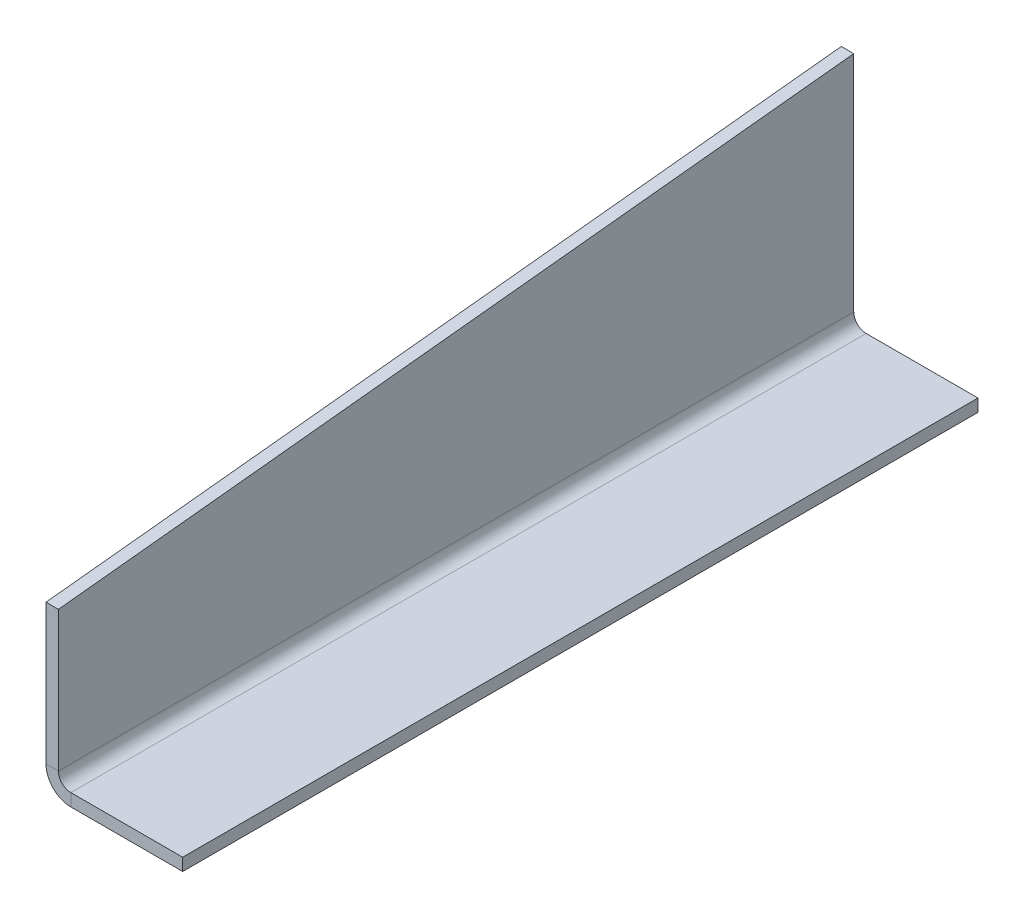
ISO-10303-21;
HEADER;
FILE_DESCRIPTION(('STEP AP214'),'2;1');
FILE_NAME('part.step','',(''),(''),'','','');
FILE_SCHEMA(('AUTOMOTIVE_DESIGN { 1 0 10303 214 1 1 1 1 }'));
ENDSEC;
DATA;
#1=APPLICATION_CONTEXT('core data for automotive mechanical design processes');
#2=APPLICATION_PROTOCOL_DEFINITION('international standard','automotive_design',2000,#1);
#3=PRODUCT_CONTEXT('',#1,'mechanical');
#4=PRODUCT('Part','Part','',(#3));
#5=PRODUCT_RELATED_PRODUCT_CATEGORY('part','',(#4));
#6=PRODUCT_DEFINITION_FORMATION('','',#4);
#7=PRODUCT_DEFINITION_CONTEXT('part definition',#1,'design');
#8=PRODUCT_DEFINITION('design','',#6,#7);
#9=PRODUCT_DEFINITION_SHAPE('','',#8);
#10=(LENGTH_UNIT() NAMED_UNIT(*) SI_UNIT(.MILLI.,.METRE.));
#11=(NAMED_UNIT(*) PLANE_ANGLE_UNIT() SI_UNIT($,.RADIAN.));
#12=(NAMED_UNIT(*) SI_UNIT($,.STERADIAN.) SOLID_ANGLE_UNIT());
#13=UNCERTAINTY_MEASURE_WITH_UNIT(LENGTH_MEASURE(1.E-05),#10,'distance_accuracy_value','');
#14=(GEOMETRIC_REPRESENTATION_CONTEXT(3) GLOBAL_UNCERTAINTY_ASSIGNED_CONTEXT((#13)) GLOBAL_UNIT_ASSIGNED_CONTEXT((#10,
#11,#12)) REPRESENTATION_CONTEXT('',''));
#15=CARTESIAN_POINT('',(0.,0.,0.));
#16=DIRECTION('',(0.,0.,1.));
#17=DIRECTION('',(1.,0.,0.));
#18=AXIS2_PLACEMENT_3D('',#15,#16,#17);
#19=CARTESIAN_POINT('',(12.7000000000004,6.34999999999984,406.399999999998));
#20=DIRECTION('',(0.,0.,0.999999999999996));
#21=DIRECTION('',(1.,0.,0.));
#22=AXIS2_PLACEMENT_3D('',#19,#20,#21);
#23=PLANE('',#22);
#24=DIRECTION('',(0.,0.999999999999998,0.));
#25=VECTOR('',#24,1.);
#26=CARTESIAN_POINT('',(6.3500000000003,1.80411241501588E-13,406.399999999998));
#27=LINE('',#26,#25);
#28=CARTESIAN_POINT('',(6.35000000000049,12.7,406.399999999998));
#29=VERTEX_POINT('',#28);
#30=CARTESIAN_POINT('',(6.35000000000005,84.2856387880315,406.399999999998));
#31=VERTEX_POINT('',#30);
#32=EDGE_CURVE('E153',#29,#31,#27,.T.);
#33=ORIENTED_EDGE('',*,*,#32,.T.);
#34=DIRECTION('',(1.,0.,0.));
#35=VECTOR('',#34,1.);
#36=CARTESIAN_POINT('',(-539.341297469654,84.2856387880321,406.399999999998));
#37=LINE('',#36,#35);
#38=CARTESIAN_POINT('',(0.,84.2856387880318,406.399999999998));
#39=VERTEX_POINT('',#38);
#40=EDGE_CURVE('E198',#39,#31,#37,.T.);
#41=ORIENTED_EDGE('',*,*,#40,.F.);
#42=DIRECTION('',(0.,0.999999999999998,0.));
#43=VECTOR('',#42,1.);
#44=CARTESIAN_POINT('',(3.88578058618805E-13,0.,406.399999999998));
#45=LINE('',#44,#43);
#46=CARTESIAN_POINT('',(3.88578058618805E-13,12.6999999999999,406.399999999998));
#47=VERTEX_POINT('',#46);
#48=EDGE_CURVE('E172',#47,#39,#45,.T.);
#49=ORIENTED_EDGE('',*,*,#48,.F.);
#50=DIRECTION('',(1.,0.,0.));
#51=VECTOR('',#50,1.);
#52=CARTESIAN_POINT('',(3.88578058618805E-13,12.6999999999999,406.399999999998));
#53=LINE('',#52,#51);
#54=EDGE_CURVE('E11',#47,#29,#53,.T.);
#55=ORIENTED_EDGE('',*,*,#54,.T.);
#56=EDGE_LOOP('',(#33,#41,#49,#55));
#57=FACE_BOUND('',#56,.T.);
#58=ADVANCED_FACE('F36',(#57),#23,.T.);
#59=CARTESIAN_POINT('',(6.3500000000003,1.80411241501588E-13,406.399999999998));
#60=DIRECTION('',(-1.,0.,0.));
#61=DIRECTION('',(0.,0.,0.999999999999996));
#62=AXIS2_PLACEMENT_3D('',#59,#60,#61);
#63=PLANE('',#62);
#64=DIRECTION('',(0.,0.104528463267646,-0.994521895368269));
#65=VECTOR('',#64,1.);
#66=CARTESIAN_POINT('',(6.35000000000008,83.3647170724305,415.161984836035));
#67=LINE('',#66,#65);
#68=CARTESIAN_POINT('',(6.35000000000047,127.,0.));
#69=VERTEX_POINT('',#68);
#70=EDGE_CURVE('E138',#31,#69,#67,.T.);
#71=ORIENTED_EDGE('',*,*,#70,.F.);
#72=ORIENTED_EDGE('',*,*,#32,.F.);
#73=DIRECTION('',(0.,0.,-0.999999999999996));
#74=VECTOR('',#73,1.);
#75=CARTESIAN_POINT('',(6.35000000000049,12.7,406.399999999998));
#76=LINE('',#75,#74);
#77=CARTESIAN_POINT('',(6.35000000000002,12.7,0.));
#78=VERTEX_POINT('',#77);
#79=EDGE_CURVE('E133',#29,#78,#76,.T.);
#80=ORIENTED_EDGE('',*,*,#79,.T.);
#81=DIRECTION('',(0.,0.999999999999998,0.));
#82=VECTOR('',#81,1.);
#83=CARTESIAN_POINT('',(6.35000000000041,-2.35922392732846E-13,0.));
#84=LINE('',#83,#82);
#85=EDGE_CURVE('E134',#78,#69,#84,.T.);
#86=ORIENTED_EDGE('',*,*,#85,.T.);
#87=EDGE_LOOP('',(#71,#72,#80,#86));
#88=FACE_BOUND('',#87,.T.);
#89=ADVANCED_FACE('F188',(#88),#63,.F.);
#90=CARTESIAN_POINT('',(3.88578058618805E-13,0.,406.399999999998));
#91=DIRECTION('',(-1.,0.,0.));
#92=DIRECTION('',(0.,0.,0.999999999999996));
#93=AXIS2_PLACEMENT_3D('',#90,#91,#92);
#94=PLANE('',#93);
#95=ORIENTED_EDGE('',*,*,#48,.T.);
#96=DIRECTION('',(0.,0.104528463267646,-0.994521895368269));
#97=VECTOR('',#96,1.);
#98=CARTESIAN_POINT('',(1.66533453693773E-13,83.364717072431,415.161984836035));
#99=LINE('',#98,#97);
#100=CARTESIAN_POINT('',(0.,127.,0.));
#101=VERTEX_POINT('',#100);
#102=EDGE_CURVE('E205',#39,#101,#99,.T.);
#103=ORIENTED_EDGE('',*,*,#102,.T.);
#104=DIRECTION('',(0.,0.999999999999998,0.));
#105=VECTOR('',#104,1.);
#106=CARTESIAN_POINT('',(0.,0.,0.));
#107=LINE('',#106,#105);
#108=CARTESIAN_POINT('',(4.44089209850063E-13,12.6999999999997,-3.60822483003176E-13));
#109=VERTEX_POINT('',#108);
#110=EDGE_CURVE('E141',#109,#101,#107,.T.);
#111=ORIENTED_EDGE('',*,*,#110,.F.);
#112=DIRECTION('',(0.,0.,-0.999999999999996));
#113=VECTOR('',#112,1.);
#114=CARTESIAN_POINT('',(3.88578058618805E-13,12.6999999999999,406.399999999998));
#115=LINE('',#114,#113);
#116=EDGE_CURVE('E161',#47,#109,#115,.T.);
#117=ORIENTED_EDGE('',*,*,#116,.F.);
#118=EDGE_LOOP('',(#95,#103,#111,#117));
#119=FACE_BOUND('',#118,.T.);
#120=ADVANCED_FACE('F186',(#119),#94,.T.);
#121=CARTESIAN_POINT('',(3.88578058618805E-13,12.6999999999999,406.399999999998));
#122=DIRECTION('',(0.,0.,0.999999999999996));
#123=DIRECTION('',(1.,0.,0.));
#124=AXIS2_PLACEMENT_3D('',#121,#122,#123);
#125=PLANE('',#124);
#126=ORIENTED_EDGE('',*,*,#54,.F.);
#127=CARTESIAN_POINT('',(12.7000000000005,12.7000000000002,406.399999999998));
#128=DIRECTION('',(0.,0.,0.999999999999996));
#129=DIRECTION('',(1.,0.,0.));
#130=AXIS2_PLACEMENT_3D('',#127,#128,#129);
#131=CIRCLE('',#130,12.7);
#132=CARTESIAN_POINT('',(12.7,0.,406.399999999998));
#133=VERTEX_POINT('',#132);
#134=EDGE_CURVE('E128',#133,#47,#131,.F.);
#135=ORIENTED_EDGE('',*,*,#134,.F.);
#136=DIRECTION('',(0.,-0.999999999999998,0.));
#137=VECTOR('',#136,1.);
#138=CARTESIAN_POINT('',(12.7000000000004,6.34999999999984,406.399999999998));
#139=LINE('',#138,#137);
#140=CARTESIAN_POINT('',(12.7000000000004,6.34999999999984,406.399999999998));
#141=VERTEX_POINT('',#140);
#142=EDGE_CURVE('E45',#141,#133,#139,.T.);
#143=ORIENTED_EDGE('',*,*,#142,.F.);
#144=CARTESIAN_POINT('',(12.7000000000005,12.7000000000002,406.399999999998));
#145=DIRECTION('',(0.,0.,0.999999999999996));
#146=DIRECTION('',(1.,0.,0.));
#147=AXIS2_PLACEMENT_3D('',#144,#145,#146);
#148=CIRCLE('',#147,6.35);
#149=EDGE_CURVE('E121',#141,#29,#148,.F.);
#150=ORIENTED_EDGE('',*,*,#149,.T.);
#151=EDGE_LOOP('',(#126,#135,#143,#150));
#152=FACE_BOUND('',#151,.T.);
#153=ADVANCED_FACE('F38',(#152),#125,.T.);
#154=CARTESIAN_POINT('',(12.7000000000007,-1.52655665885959E-13,0.));
#155=DIRECTION('',(0.,0.,-0.999999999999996));
#156=DIRECTION('',(-1.,0.,0.));
#157=AXIS2_PLACEMENT_3D('',#154,#155,#156);
#158=PLANE('',#157);
#159=DIRECTION('',(0.,0.999999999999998,0.));
#160=VECTOR('',#159,1.);
#161=CARTESIAN_POINT('',(12.7000000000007,-1.52655665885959E-13,0.));
#162=LINE('',#161,#160);
#163=CARTESIAN_POINT('',(12.7000000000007,-1.52655665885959E-13,0.));
#164=VERTEX_POINT('',#163);
#165=CARTESIAN_POINT('',(12.7000000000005,6.34999999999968,-1.94289029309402E-13));
#166=VERTEX_POINT('',#165);
#167=EDGE_CURVE('E78',#164,#166,#162,.T.);
#168=ORIENTED_EDGE('',*,*,#167,.F.);
#169=CARTESIAN_POINT('',(12.7000000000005,12.6999999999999,-4.71844785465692E-13));
#170=DIRECTION('',(0.,0.,0.999999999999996));
#171=DIRECTION('',(1.,0.,0.));
#172=AXIS2_PLACEMENT_3D('',#169,#170,#171);
#173=CIRCLE('',#172,12.7);
#174=EDGE_CURVE('E144',#164,#109,#173,.F.);
#175=ORIENTED_EDGE('',*,*,#174,.T.);
#176=DIRECTION('',(-1.,0.,0.));
#177=VECTOR('',#176,1.);
#178=CARTESIAN_POINT('',(6.35000000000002,12.7,0.));
#179=LINE('',#178,#177);
#180=EDGE_CURVE('E85',#78,#109,#179,.T.);
#181=ORIENTED_EDGE('',*,*,#180,.F.);
#182=CARTESIAN_POINT('',(12.7000000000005,12.6999999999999,-4.71844785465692E-13));
#183=DIRECTION('',(0.,0.,0.999999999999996));
#184=DIRECTION('',(1.,0.,0.));
#185=AXIS2_PLACEMENT_3D('',#182,#183,#184);
#186=CIRCLE('',#185,6.35);
#187=EDGE_CURVE('E151',#166,#78,#186,.F.);
#188=ORIENTED_EDGE('',*,*,#187,.F.);
#189=EDGE_LOOP('',(#168,#175,#181,#188));
#190=FACE_BOUND('',#189,.T.);
#191=ADVANCED_FACE('F178',(#190),#158,.T.);
#192=CARTESIAN_POINT('',(6.35000000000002,12.7,0.));
#193=DIRECTION('',(0.,0.,-0.999999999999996));
#194=DIRECTION('',(-1.,0.,0.));
#195=AXIS2_PLACEMENT_3D('',#192,#193,#194);
#196=PLANE('',#195);
#197=DIRECTION('',(-1.,0.,0.));
#198=VECTOR('',#197,1.);
#199=CARTESIAN_POINT('',(0.,0.,0.));
#200=LINE('',#199,#198);
#201=CARTESIAN_POINT('',(69.8500000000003,-2.4980018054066E-13,0.));
#202=VERTEX_POINT('',#201);
#203=EDGE_CURVE('E146',#202,#164,#200,.T.);
#204=ORIENTED_EDGE('',*,*,#203,.T.);
#205=ORIENTED_EDGE('',*,*,#167,.T.);
#206=DIRECTION('',(1.,0.,0.));
#207=VECTOR('',#206,1.);
#208=CARTESIAN_POINT('',(6.10622663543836E-13,6.34999999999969,-1.66533453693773E-13));
#209=LINE('',#208,#207);
#210=CARTESIAN_POINT('',(69.8500000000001,6.34999999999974,-3.05311331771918E-13));
#211=VERTEX_POINT('',#210);
#212=EDGE_CURVE('E149',#211,#166,#209,.F.);
#213=ORIENTED_EDGE('',*,*,#212,.F.);
#214=DIRECTION('',(0.,-0.999999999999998,0.));
#215=VECTOR('',#214,1.);
#216=CARTESIAN_POINT('',(69.8500000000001,6.34999999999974,-3.05311331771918E-13));
#217=LINE('',#216,#215);
#218=EDGE_CURVE('E109',#211,#202,#217,.T.);
#219=ORIENTED_EDGE('',*,*,#218,.T.);
#220=EDGE_LOOP('',(#204,#205,#213,#219));
#221=FACE_BOUND('',#220,.T.);
#222=ADVANCED_FACE('F174',(#221),#196,.T.);
#223=CARTESIAN_POINT('',(12.7000000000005,12.7000000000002,406.399999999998));
#224=DIRECTION('',(0.,0.,-0.999999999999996));
#225=DIRECTION('',(-1.,0.,0.));
#226=AXIS2_PLACEMENT_3D('',#223,#224,#225);
#227=CYLINDRICAL_SURFACE('',#226,12.7);
#228=ORIENTED_EDGE('',*,*,#174,.F.);
#229=DIRECTION('',(0.,0.,-0.999999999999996));
#230=VECTOR('',#229,1.);
#231=CARTESIAN_POINT('',(12.7,0.,406.399999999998));
#232=LINE('',#231,#230);
#233=EDGE_CURVE('E158',#133,#164,#232,.T.);
#234=ORIENTED_EDGE('',*,*,#233,.F.);
#235=ORIENTED_EDGE('',*,*,#134,.T.);
#236=ORIENTED_EDGE('',*,*,#116,.T.);
#237=EDGE_LOOP('',(#228,#234,#235,#236));
#238=FACE_BOUND('',#237,.T.);
#239=ADVANCED_FACE('F169',(#238),#227,.T.);
#240=CARTESIAN_POINT('',(3.88578058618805E-13,0.,406.399999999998));
#241=DIRECTION('',(0.,-0.999999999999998,0.));
#242=DIRECTION('',(0.,0.,-0.999999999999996));
#243=AXIS2_PLACEMENT_3D('',#240,#241,#242);
#244=PLANE('',#243);
#245=ORIENTED_EDGE('',*,*,#203,.F.);
#246=DIRECTION('',(0.,0.,-0.999999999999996));
#247=VECTOR('',#246,1.);
#248=CARTESIAN_POINT('',(69.8500000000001,1.52655665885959E-13,406.399999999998));
#249=LINE('',#248,#247);
#250=CARTESIAN_POINT('',(69.8500000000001,1.52655665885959E-13,406.399999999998));
#251=VERTEX_POINT('',#250);
#252=EDGE_CURVE('E111',#251,#202,#249,.T.);
#253=ORIENTED_EDGE('',*,*,#252,.F.);
#254=DIRECTION('',(-1.,0.,0.));
#255=VECTOR('',#254,1.);
#256=CARTESIAN_POINT('',(3.88578058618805E-13,0.,406.399999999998));
#257=LINE('',#256,#255);
#258=EDGE_CURVE('E126',#251,#133,#257,.T.);
#259=ORIENTED_EDGE('',*,*,#258,.T.);
#260=ORIENTED_EDGE('',*,*,#233,.T.);
#261=EDGE_LOOP('',(#245,#253,#259,#260));
#262=FACE_BOUND('',#261,.T.);
#263=ADVANCED_FACE('F173',(#262),#244,.T.);
#264=CARTESIAN_POINT('',(69.85,6.34999999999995,406.399999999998));
#265=DIRECTION('',(1.,0.,0.));
#266=DIRECTION('',(0.,0.,-0.999999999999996));
#267=AXIS2_PLACEMENT_3D('',#264,#265,#266);
#268=PLANE('',#267);
#269=ORIENTED_EDGE('',*,*,#218,.F.);
#270=DIRECTION('',(0.,0.,-0.999999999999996));
#271=VECTOR('',#270,1.);
#272=CARTESIAN_POINT('',(69.85,6.34999999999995,406.399999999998));
#273=LINE('',#272,#271);
#274=CARTESIAN_POINT('',(69.85,6.34999999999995,406.399999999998));
#275=VERTEX_POINT('',#274);
#276=EDGE_CURVE('E103',#275,#211,#273,.T.);
#277=ORIENTED_EDGE('',*,*,#276,.F.);
#278=DIRECTION('',(0.,-0.999999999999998,0.));
#279=VECTOR('',#278,1.);
#280=CARTESIAN_POINT('',(69.85,6.34999999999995,406.399999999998));
#281=LINE('',#280,#279);
#282=EDGE_CURVE('E107',#275,#251,#281,.T.);
#283=ORIENTED_EDGE('',*,*,#282,.T.);
#284=ORIENTED_EDGE('',*,*,#252,.T.);
#285=EDGE_LOOP('',(#269,#277,#283,#284));
#286=FACE_BOUND('',#285,.T.);
#287=ADVANCED_FACE('F105',(#286),#268,.T.);
#288=CARTESIAN_POINT('',(0.,6.35000000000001,406.399999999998));
#289=DIRECTION('',(0.,-0.999999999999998,0.));
#290=DIRECTION('',(0.,0.,-0.999999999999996));
#291=AXIS2_PLACEMENT_3D('',#288,#289,#290);
#292=PLANE('',#291);
#293=ORIENTED_EDGE('',*,*,#212,.T.);
#294=DIRECTION('',(0.,0.,-0.999999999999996));
#295=VECTOR('',#294,1.);
#296=CARTESIAN_POINT('',(12.7000000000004,6.34999999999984,406.399999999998));
#297=LINE('',#296,#295);
#298=EDGE_CURVE('E112',#141,#166,#297,.T.);
#299=ORIENTED_EDGE('',*,*,#298,.F.);
#300=DIRECTION('',(1.,0.,0.));
#301=VECTOR('',#300,1.);
#302=CARTESIAN_POINT('',(0.,6.35000000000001,406.399999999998));
#303=LINE('',#302,#301);
#304=EDGE_CURVE('E116',#275,#141,#303,.F.);
#305=ORIENTED_EDGE('',*,*,#304,.F.);
#306=ORIENTED_EDGE('',*,*,#276,.T.);
#307=EDGE_LOOP('',(#293,#299,#305,#306));
#308=FACE_BOUND('',#307,.T.);
#309=ADVANCED_FACE('F117',(#308),#292,.F.);
#310=CARTESIAN_POINT('',(12.7000000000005,12.7000000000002,406.399999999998));
#311=DIRECTION('',(0.,0.,-0.999999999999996));
#312=DIRECTION('',(-1.,0.,0.));
#313=AXIS2_PLACEMENT_3D('',#310,#311,#312);
#314=CYLINDRICAL_SURFACE('',#313,6.35);
#315=ORIENTED_EDGE('',*,*,#187,.T.);
#316=ORIENTED_EDGE('',*,*,#79,.F.);
#317=ORIENTED_EDGE('',*,*,#149,.F.);
#318=ORIENTED_EDGE('',*,*,#298,.T.);
#319=EDGE_LOOP('',(#315,#316,#317,#318));
#320=FACE_BOUND('',#319,.T.);
#321=ADVANCED_FACE('F176',(#320),#314,.F.);
#322=CARTESIAN_POINT('',(12.7000000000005,12.7000000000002,406.399999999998));
#323=DIRECTION('',(0.,0.,0.999999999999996));
#324=DIRECTION('',(1.,0.,0.));
#325=AXIS2_PLACEMENT_3D('',#322,#323,#324);
#326=PLANE('',#325);
#327=ORIENTED_EDGE('',*,*,#304,.T.);
#328=ORIENTED_EDGE('',*,*,#142,.T.);
#329=ORIENTED_EDGE('',*,*,#258,.F.);
#330=ORIENTED_EDGE('',*,*,#282,.F.);
#331=EDGE_LOOP('',(#327,#328,#329,#330));
#332=FACE_BOUND('',#331,.T.);
#333=ADVANCED_FACE('F124',(#332),#326,.T.);
#334=CARTESIAN_POINT('',(12.7000000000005,12.6999999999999,-4.71844785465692E-13));
#335=DIRECTION('',(0.,0.,0.999999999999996));
#336=DIRECTION('',(1.,0.,0.));
#337=AXIS2_PLACEMENT_3D('',#334,#335,#336);
#338=PLANE('',#337);
#339=ORIENTED_EDGE('',*,*,#85,.F.);
#340=ORIENTED_EDGE('',*,*,#180,.T.);
#341=ORIENTED_EDGE('',*,*,#110,.T.);
#342=DIRECTION('',(1.,0.,0.));
#343=VECTOR('',#342,1.);
#344=CARTESIAN_POINT('',(0.,127.,0.));
#345=LINE('',#344,#343);
#346=EDGE_CURVE('E137',#101,#69,#345,.T.);
#347=ORIENTED_EDGE('',*,*,#346,.T.);
#348=EDGE_LOOP('',(#339,#340,#341,#347));
#349=FACE_BOUND('',#348,.T.);
#350=ADVANCED_FACE('F214',(#349),#338,.F.);
#351=CARTESIAN_POINT('',(-539.341297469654,127.,4.9960036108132E-13));
#352=DIRECTION('',(0.,0.994521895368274,0.104528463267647));
#353=DIRECTION('',(0.,-0.104528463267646,0.994521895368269));
#354=AXIS2_PLACEMENT_3D('',#351,#352,#353);
#355=PLANE('',#354);
#356=ORIENTED_EDGE('',*,*,#40,.T.);
#357=ORIENTED_EDGE('',*,*,#70,.T.);
#358=ORIENTED_EDGE('',*,*,#346,.F.);
#359=ORIENTED_EDGE('',*,*,#102,.F.);
#360=EDGE_LOOP('',(#356,#357,#358,#359));
#361=FACE_BOUND('',#360,.T.);
#362=ADVANCED_FACE('F210',(#361),#355,.T.);
#363=CLOSED_SHELL('',(#58,#89,#120,#153,#191,#222,#239,#263,#287,#309,#321,#333,#350,#362));
#364=MANIFOLD_SOLID_BREP('B2',#363);
#365=ADVANCED_BREP_SHAPE_REPRESENTATION('',(#18,#364),#14);
#366=SHAPE_DEFINITION_REPRESENTATION(#9,#365);
ENDSEC;
END-ISO-10303-21;
